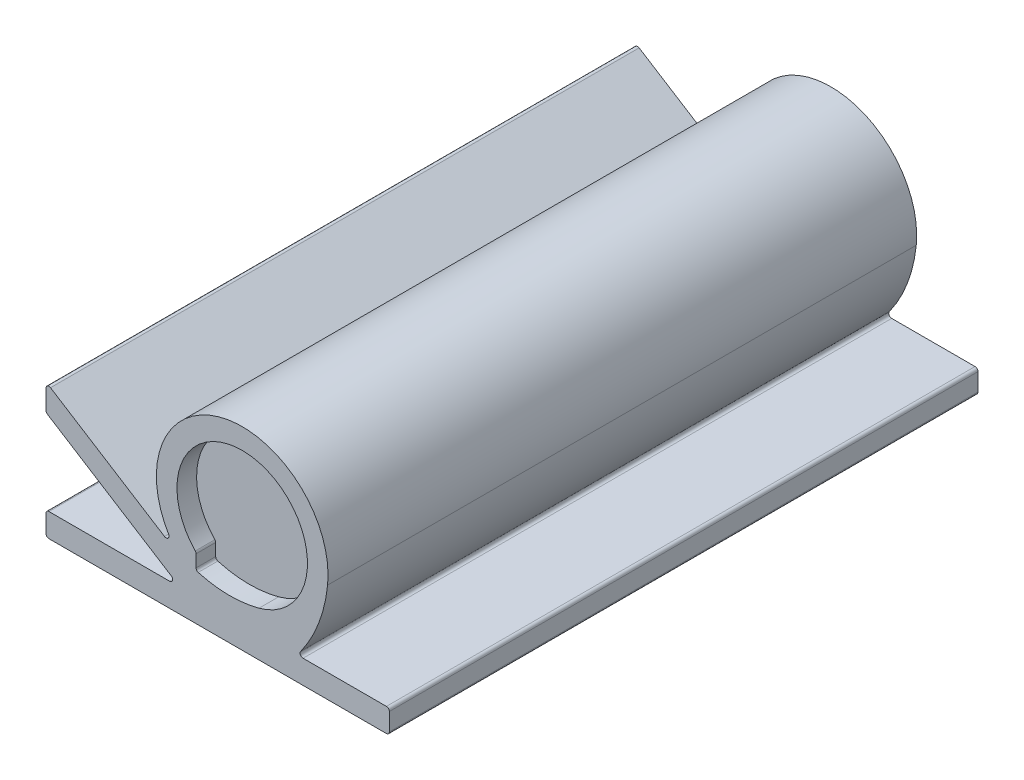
ISO-10303-21;
HEADER;
FILE_DESCRIPTION(('STEP AP214'),'2;1');
FILE_NAME('part.step','',(''),(''),'','','');
FILE_SCHEMA(('AUTOMOTIVE_DESIGN { 1 0 10303 214 1 1 1 1 }'));
ENDSEC;
DATA;
#1=APPLICATION_CONTEXT('core data for automotive mechanical design processes');
#2=APPLICATION_PROTOCOL_DEFINITION('international standard','automotive_design',2000,#1);
#3=PRODUCT_CONTEXT('',#1,'mechanical');
#4=PRODUCT('Part','Part','',(#3));
#5=PRODUCT_RELATED_PRODUCT_CATEGORY('part','',(#4));
#6=PRODUCT_DEFINITION_FORMATION('','',#4);
#7=PRODUCT_DEFINITION_CONTEXT('part definition',#1,'design');
#8=PRODUCT_DEFINITION('design','',#6,#7);
#9=PRODUCT_DEFINITION_SHAPE('','',#8);
#10=(LENGTH_UNIT() NAMED_UNIT(*) SI_UNIT(.MILLI.,.METRE.));
#11=(NAMED_UNIT(*) PLANE_ANGLE_UNIT() SI_UNIT($,.RADIAN.));
#12=(NAMED_UNIT(*) SI_UNIT($,.STERADIAN.) SOLID_ANGLE_UNIT());
#13=UNCERTAINTY_MEASURE_WITH_UNIT(LENGTH_MEASURE(1.E-05),#10,'distance_accuracy_value','');
#14=(GEOMETRIC_REPRESENTATION_CONTEXT(3) GLOBAL_UNCERTAINTY_ASSIGNED_CONTEXT((#13)) GLOBAL_UNIT_ASSIGNED_CONTEXT((#10,
#11,#12)) REPRESENTATION_CONTEXT('',''));
#15=CARTESIAN_POINT('',(0.,0.,0.));
#16=DIRECTION('',(0.,0.,1.));
#17=DIRECTION('',(1.,0.,0.));
#18=AXIS2_PLACEMENT_3D('',#15,#16,#17);
#19=CARTESIAN_POINT('',(-20.,0.,60.));
#20=DIRECTION('',(1.,0.,0.));
#21=DIRECTION('',(0.,0.,-1.));
#22=AXIS2_PLACEMENT_3D('',#19,#20,#21);
#23=PLANE('',#22);
#24=DIRECTION('',(0.,-1.,0.));
#25=VECTOR('',#24,1.);
#26=CARTESIAN_POINT('',(-20.,0.,0.));
#27=LINE('',#26,#25);
#28=CARTESIAN_POINT('',(-20.,2.1,0.));
#29=VERTEX_POINT('',#28);
#30=CARTESIAN_POINT('',(-20.,0.3,0.));
#31=VERTEX_POINT('',#30);
#32=EDGE_CURVE('E226',#29,#31,#27,.T.);
#33=ORIENTED_EDGE('',*,*,#32,.T.);
#34=DIRECTION('',(0.,0.,-1.));
#35=VECTOR('',#34,1.);
#36=CARTESIAN_POINT('',(-20.,0.3,60.));
#37=LINE('',#36,#35);
#38=CARTESIAN_POINT('',(-20.,0.3,60.));
#39=VERTEX_POINT('',#38);
#40=EDGE_CURVE('E434',#31,#39,#37,.F.);
#41=ORIENTED_EDGE('',*,*,#40,.T.);
#42=DIRECTION('',(0.,-1.,0.));
#43=VECTOR('',#42,1.);
#44=CARTESIAN_POINT('',(-20.,0.,60.));
#45=LINE('',#44,#43);
#46=CARTESIAN_POINT('',(-20.,2.1,60.));
#47=VERTEX_POINT('',#46);
#48=EDGE_CURVE('E245',#47,#39,#45,.T.);
#49=ORIENTED_EDGE('',*,*,#48,.F.);
#50=DIRECTION('',(0.,0.,-1.));
#51=VECTOR('',#50,1.);
#52=CARTESIAN_POINT('',(-20.,2.1,60.));
#53=LINE('',#52,#51);
#54=EDGE_CURVE('E430',#47,#29,#53,.T.);
#55=ORIENTED_EDGE('',*,*,#54,.T.);
#56=EDGE_LOOP('',(#33,#41,#49,#55));
#57=FACE_BOUND('',#56,.T.);
#58=ADVANCED_FACE('F39',(#57),#23,.F.);
#59=CARTESIAN_POINT('',(-20.,0.,60.));
#60=DIRECTION('',(0.,1.,0.));
#61=DIRECTION('',(0.,0.,1.));
#62=AXIS2_PLACEMENT_3D('',#59,#60,#61);
#63=PLANE('',#62);
#64=DIRECTION('',(1.,0.,0.));
#65=VECTOR('',#64,1.);
#66=CARTESIAN_POINT('',(-20.,0.,0.));
#67=LINE('',#66,#65);
#68=CARTESIAN_POINT('',(-19.7,0.,0.));
#69=VERTEX_POINT('',#68);
#70=CARTESIAN_POINT('',(14.7,0.,0.));
#71=VERTEX_POINT('',#70);
#72=EDGE_CURVE('E287',#69,#71,#67,.T.);
#73=ORIENTED_EDGE('',*,*,#72,.T.);
#74=DIRECTION('',(0.,0.,-1.));
#75=VECTOR('',#74,1.);
#76=CARTESIAN_POINT('',(14.7,0.,60.));
#77=LINE('',#76,#75);
#78=CARTESIAN_POINT('',(14.7,0.,60.));
#79=VERTEX_POINT('',#78);
#80=EDGE_CURVE('E399',#71,#79,#77,.F.);
#81=ORIENTED_EDGE('',*,*,#80,.T.);
#82=DIRECTION('',(1.,0.,0.));
#83=VECTOR('',#82,1.);
#84=CARTESIAN_POINT('',(-20.,0.,60.));
#85=LINE('',#84,#83);
#86=CARTESIAN_POINT('',(-19.7,0.,60.));
#87=VERTEX_POINT('',#86);
#88=EDGE_CURVE('E249',#87,#79,#85,.T.);
#89=ORIENTED_EDGE('',*,*,#88,.F.);
#90=DIRECTION('',(0.,0.,-1.));
#91=VECTOR('',#90,1.);
#92=CARTESIAN_POINT('',(-19.7,0.,60.));
#93=LINE('',#92,#91);
#94=EDGE_CURVE('E395',#87,#69,#93,.T.);
#95=ORIENTED_EDGE('',*,*,#94,.T.);
#96=EDGE_LOOP('',(#73,#81,#89,#95));
#97=FACE_BOUND('',#96,.T.);
#98=ADVANCED_FACE('F490',(#97),#63,.F.);
#99=CARTESIAN_POINT('',(15.,0.,60.));
#100=DIRECTION('',(-1.,0.,0.));
#101=DIRECTION('',(0.,0.,1.));
#102=AXIS2_PLACEMENT_3D('',#99,#100,#101);
#103=PLANE('',#102);
#104=DIRECTION('',(0.,1.,0.));
#105=VECTOR('',#104,1.);
#106=CARTESIAN_POINT('',(15.,0.,60.));
#107=LINE('',#106,#105);
#108=CARTESIAN_POINT('',(15.,0.3,60.));
#109=VERTEX_POINT('',#108);
#110=CARTESIAN_POINT('',(15.,2.1,60.));
#111=VERTEX_POINT('',#110);
#112=EDGE_CURVE('E254',#109,#111,#107,.T.);
#113=ORIENTED_EDGE('',*,*,#112,.F.);
#114=DIRECTION('',(0.,0.,-1.));
#115=VECTOR('',#114,1.);
#116=CARTESIAN_POINT('',(15.,0.3,60.));
#117=LINE('',#116,#115);
#118=CARTESIAN_POINT('',(15.,0.3,0.));
#119=VERTEX_POINT('',#118);
#120=EDGE_CURVE('E373',#109,#119,#117,.T.);
#121=ORIENTED_EDGE('',*,*,#120,.T.);
#122=DIRECTION('',(0.,1.,0.));
#123=VECTOR('',#122,1.);
#124=CARTESIAN_POINT('',(15.,0.,0.));
#125=LINE('',#124,#123);
#126=CARTESIAN_POINT('',(15.,2.1,0.));
#127=VERTEX_POINT('',#126);
#128=EDGE_CURVE('E291',#119,#127,#125,.T.);
#129=ORIENTED_EDGE('',*,*,#128,.T.);
#130=DIRECTION('',(0.,0.,-1.));
#131=VECTOR('',#130,1.);
#132=CARTESIAN_POINT('',(15.,2.1,60.));
#133=LINE('',#132,#131);
#134=EDGE_CURVE('E370',#127,#111,#133,.F.);
#135=ORIENTED_EDGE('',*,*,#134,.T.);
#136=EDGE_LOOP('',(#113,#121,#129,#135));
#137=FACE_BOUND('',#136,.T.);
#138=ADVANCED_FACE('F482',(#137),#103,.F.);
#139=CARTESIAN_POINT('',(15.,2.4,60.));
#140=DIRECTION('',(0.,-1.,0.));
#141=DIRECTION('',(1.,0.,0.));
#142=AXIS2_PLACEMENT_3D('',#139,#140,#141);
#143=PLANE('',#142);
#144=DIRECTION('',(-1.,0.,0.));
#145=VECTOR('',#144,1.);
#146=CARTESIAN_POINT('',(15.,2.4,0.));
#147=LINE('',#146,#145);
#148=CARTESIAN_POINT('',(14.7,2.4,0.));
#149=VERTEX_POINT('',#148);
#150=CARTESIAN_POINT('',(6.20009702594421,2.4,0.));
#151=VERTEX_POINT('',#150);
#152=EDGE_CURVE('E295',#149,#151,#147,.T.);
#153=ORIENTED_EDGE('',*,*,#152,.T.);
#154=DIRECTION('',(0.,0.,1.));
#155=VECTOR('',#154,1.);
#156=CARTESIAN_POINT('',(6.20009702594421,2.4,60.));
#157=LINE('',#156,#155);
#158=CARTESIAN_POINT('',(6.20009702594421,2.4,60.));
#159=VERTEX_POINT('',#158);
#160=EDGE_CURVE('E367',#151,#159,#157,.T.);
#161=ORIENTED_EDGE('',*,*,#160,.T.);
#162=DIRECTION('',(-1.,0.,0.));
#163=VECTOR('',#162,1.);
#164=CARTESIAN_POINT('',(15.,2.4,60.));
#165=LINE('',#164,#163);
#166=CARTESIAN_POINT('',(14.7,2.4,60.));
#167=VERTEX_POINT('',#166);
#168=EDGE_CURVE('E258',#167,#159,#165,.T.);
#169=ORIENTED_EDGE('',*,*,#168,.F.);
#170=DIRECTION('',(0.,0.,-1.));
#171=VECTOR('',#170,1.);
#172=CARTESIAN_POINT('',(14.7,2.4,60.));
#173=LINE('',#172,#171);
#174=EDGE_CURVE('E363',#167,#149,#173,.T.);
#175=ORIENTED_EDGE('',*,*,#174,.T.);
#176=EDGE_LOOP('',(#153,#161,#169,#175));
#177=FACE_BOUND('',#176,.T.);
#178=ADVANCED_FACE('F474',(#177),#143,.F.);
#179=CARTESIAN_POINT('',(-6.21729001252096,11.6385960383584,60.));
#180=DIRECTION('',(0.,0.,-1.));
#181=DIRECTION('',(-1.,0.,0.));
#182=AXIS2_PLACEMENT_3D('',#179,#180,#181);
#183=CYLINDRICAL_SURFACE('',#182,15.);
#184=CARTESIAN_POINT('',(-6.21729001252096,11.6385960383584,60.));
#185=DIRECTION('',(0.,0.,1.));
#186=DIRECTION('',(1.,0.,0.));
#187=AXIS2_PLACEMENT_3D('',#184,#185,#186);
#188=CIRCLE('',#187,15.);
#189=CARTESIAN_POINT('',(5.9566188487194,2.87526658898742,60.));
#190=VERTEX_POINT('',#189);
#191=CARTESIAN_POINT('',(8.70420601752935,10.1059655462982,60.));
#192=VERTEX_POINT('',#191);
#193=EDGE_CURVE('E262',#190,#192,#188,.T.);
#194=ORIENTED_EDGE('',*,*,#193,.F.);
#195=DIRECTION('',(0.,0.,-1.));
#196=VECTOR('',#195,1.);
#197=CARTESIAN_POINT('',(5.9566188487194,2.87526658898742,60.));
#198=LINE('',#197,#196);
#199=CARTESIAN_POINT('',(5.9566188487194,2.87526658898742,0.));
#200=VERTEX_POINT('',#199);
#201=EDGE_CURVE('E359',#190,#200,#198,.T.);
#202=ORIENTED_EDGE('',*,*,#201,.T.);
#203=CARTESIAN_POINT('',(-6.21729001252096,11.6385960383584,0.));
#204=DIRECTION('',(0.,0.,1.));
#205=DIRECTION('',(1.,0.,0.));
#206=AXIS2_PLACEMENT_3D('',#203,#204,#205);
#207=CIRCLE('',#206,15.);
#208=CARTESIAN_POINT('',(8.70420601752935,10.1059655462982,0.));
#209=VERTEX_POINT('',#208);
#210=EDGE_CURVE('E299',#200,#209,#207,.T.);
#211=ORIENTED_EDGE('',*,*,#210,.T.);
#212=DIRECTION('',(0.,0.,-1.));
#213=VECTOR('',#212,1.);
#214=CARTESIAN_POINT('',(8.70420601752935,10.1059655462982,60.));
#215=LINE('',#214,#213);
#216=EDGE_CURVE('E283',#192,#209,#215,.T.);
#217=ORIENTED_EDGE('',*,*,#216,.F.);
#218=EDGE_LOOP('',(#194,#202,#211,#217));
#219=FACE_BOUND('',#218,.T.);
#220=ADVANCED_FACE('F464',(#219),#183,.T.);
#221=CARTESIAN_POINT('',(0.,11.,60.));
#222=DIRECTION('',(0.,0.,-1.));
#223=DIRECTION('',(-1.,0.,0.));
#224=AXIS2_PLACEMENT_3D('',#221,#222,#223);
#225=CYLINDRICAL_SURFACE('',#224,8.75);
#226=CARTESIAN_POINT('',(0.,11.,0.));
#227=DIRECTION('',(0.,0.,1.));
#228=DIRECTION('',(1.,0.,0.));
#229=AXIS2_PLACEMENT_3D('',#226,#227,#228);
#230=CIRCLE('',#229,8.75);
#231=CARTESIAN_POINT('',(-7.50242086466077,6.49709192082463,0.));
#232=VERTEX_POINT('',#231);
#233=EDGE_CURVE('E302',#209,#232,#230,.T.);
#234=ORIENTED_EDGE('',*,*,#233,.T.);
#235=DIRECTION('',(0.,0.,-1.));
#236=VECTOR('',#235,1.);
#237=CARTESIAN_POINT('',(-7.50242086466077,6.49709192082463,60.));
#238=LINE('',#237,#236);
#239=CARTESIAN_POINT('',(-7.50242086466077,6.49709192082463,60.));
#240=VERTEX_POINT('',#239);
#241=EDGE_CURVE('E342',#232,#240,#238,.F.);
#242=ORIENTED_EDGE('',*,*,#241,.T.);
#243=CARTESIAN_POINT('',(0.,11.,60.));
#244=DIRECTION('',(0.,0.,1.));
#245=DIRECTION('',(1.,0.,0.));
#246=AXIS2_PLACEMENT_3D('',#243,#244,#245);
#247=CIRCLE('',#246,8.75);
#248=EDGE_CURVE('E265',#192,#240,#247,.T.);
#249=ORIENTED_EDGE('',*,*,#248,.F.);
#250=ORIENTED_EDGE('',*,*,#216,.T.);
#251=EDGE_LOOP('',(#234,#242,#249,#250));
#252=FACE_BOUND('',#251,.T.);
#253=ADVANCED_FACE('F537',(#252),#225,.T.);
#254=CARTESIAN_POINT('',(-20.,13.7,60.));
#255=DIRECTION('',(-0.533059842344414,-0.846077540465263,0.));
#256=DIRECTION('',(0.846077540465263,-0.533059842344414,0.));
#257=AXIS2_PLACEMENT_3D('',#254,#255,#256);
#258=PLANE('',#257);
#259=DIRECTION('',(-0.846077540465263,0.533059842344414,0.));
#260=VECTOR('',#259,1.);
#261=CARTESIAN_POINT('',(-20.,13.7,60.));
#262=LINE('',#261,#260);
#263=CARTESIAN_POINT('',(-7.91956467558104,6.08888323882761,60.));
#264=VERTEX_POINT('',#263);
#265=CARTESIAN_POINT('',(-19.5400820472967,13.4102348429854,60.));
#266=VERTEX_POINT('',#265);
#267=EDGE_CURVE('E269',#264,#266,#262,.T.);
#268=ORIENTED_EDGE('',*,*,#267,.F.);
#269=DIRECTION('',(0.,0.,1.));
#270=VECTOR('',#269,1.);
#271=CARTESIAN_POINT('',(-7.91956467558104,6.08888323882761,0.));
#272=LINE('',#271,#270);
#273=CARTESIAN_POINT('',(-7.91956467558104,6.08888323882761,0.));
#274=VERTEX_POINT('',#273);
#275=EDGE_CURVE('E338',#264,#274,#272,.F.);
#276=ORIENTED_EDGE('',*,*,#275,.T.);
#277=DIRECTION('',(-0.846077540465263,0.533059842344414,0.));
#278=VECTOR('',#277,1.);
#279=CARTESIAN_POINT('',(-20.,13.7,0.));
#280=LINE('',#279,#278);
#281=CARTESIAN_POINT('',(-19.5400820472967,13.4102348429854,0.));
#282=VERTEX_POINT('',#281);
#283=EDGE_CURVE('E306',#274,#282,#280,.T.);
#284=ORIENTED_EDGE('',*,*,#283,.T.);
#285=DIRECTION('',(0.,0.,-1.));
#286=VECTOR('',#285,1.);
#287=CARTESIAN_POINT('',(-19.5400820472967,13.4102348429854,60.));
#288=LINE('',#287,#286);
#289=EDGE_CURVE('E335',#282,#266,#288,.F.);
#290=ORIENTED_EDGE('',*,*,#289,.T.);
#291=EDGE_LOOP('',(#268,#276,#284,#290));
#292=FACE_BOUND('',#291,.T.);
#293=ADVANCED_FACE('F530',(#292),#258,.F.);
#294=CARTESIAN_POINT('',(-20.,11.,60.));
#295=DIRECTION('',(1.,0.,0.));
#296=DIRECTION('',(0.,0.,-1.));
#297=AXIS2_PLACEMENT_3D('',#294,#295,#296);
#298=PLANE('',#297);
#299=DIRECTION('',(0.,-1.,0.));
#300=VECTOR('',#299,1.);
#301=CARTESIAN_POINT('',(-20.,11.,0.));
#302=LINE('',#301,#300);
#303=CARTESIAN_POINT('',(-20.,13.1564115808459,0.));
#304=VERTEX_POINT('',#303);
#305=CARTESIAN_POINT('',(-20.,11.1655664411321,0.));
#306=VERTEX_POINT('',#305);
#307=EDGE_CURVE('E310',#304,#306,#302,.T.);
#308=ORIENTED_EDGE('',*,*,#307,.T.);
#309=DIRECTION('',(0.,0.,-1.));
#310=VECTOR('',#309,1.);
#311=CARTESIAN_POINT('',(-20.,11.1655664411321,60.));
#312=LINE('',#311,#310);
#313=CARTESIAN_POINT('',(-20.,11.1655664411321,60.));
#314=VERTEX_POINT('',#313);
#315=EDGE_CURVE('E55',#306,#314,#312,.F.);
#316=ORIENTED_EDGE('',*,*,#315,.T.);
#317=DIRECTION('',(0.,-1.,0.));
#318=VECTOR('',#317,1.);
#319=CARTESIAN_POINT('',(-20.,11.,60.));
#320=LINE('',#319,#318);
#321=CARTESIAN_POINT('',(-20.,13.1564115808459,60.));
#322=VERTEX_POINT('',#321);
#323=EDGE_CURVE('E272',#322,#314,#320,.T.);
#324=ORIENTED_EDGE('',*,*,#323,.F.);
#325=DIRECTION('',(0.,0.,-1.));
#326=VECTOR('',#325,1.);
#327=CARTESIAN_POINT('',(-20.,13.1564115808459,60.));
#328=LINE('',#327,#326);
#329=EDGE_CURVE('E424',#322,#304,#328,.T.);
#330=ORIENTED_EDGE('',*,*,#329,.T.);
#331=EDGE_LOOP('',(#308,#316,#324,#330));
#332=FACE_BOUND('',#331,.T.);
#333=ADVANCED_FACE('F522',(#332),#298,.F.);
#334=CARTESIAN_POINT('',(-6.35,2.4,60.));
#335=DIRECTION('',(0.533059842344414,0.846077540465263,0.));
#336=DIRECTION('',(-0.846077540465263,0.533059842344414,0.));
#337=AXIS2_PLACEMENT_3D('',#334,#335,#336);
#338=PLANE('',#337);
#339=DIRECTION('',(0.846077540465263,-0.533059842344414,0.));
#340=VECTOR('',#339,1.);
#341=CARTESIAN_POINT('',(-6.35,2.4,0.));
#342=LINE('',#341,#340);
#343=CARTESIAN_POINT('',(-19.8599179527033,10.9117431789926,0.));
#344=VERTEX_POINT('',#343);
#345=CARTESIAN_POINT('',(-7.22903343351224,2.95382326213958,0.));
#346=VERTEX_POINT('',#345);
#347=EDGE_CURVE('E313',#344,#346,#342,.T.);
#348=ORIENTED_EDGE('',*,*,#347,.T.);
#349=DIRECTION('',(0.,0.,-1.));
#350=VECTOR('',#349,1.);
#351=CARTESIAN_POINT('',(-7.22903343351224,2.95382326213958,60.));
#352=LINE('',#351,#350);
#353=CARTESIAN_POINT('',(-7.22903343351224,2.95382326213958,60.));
#354=VERTEX_POINT('',#353);
#355=EDGE_CURVE('E356',#346,#354,#352,.F.);
#356=ORIENTED_EDGE('',*,*,#355,.T.);
#357=DIRECTION('',(0.846077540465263,-0.533059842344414,0.));
#358=VECTOR('',#357,1.);
#359=CARTESIAN_POINT('',(-6.35,2.4,60.));
#360=LINE('',#359,#358);
#361=CARTESIAN_POINT('',(-19.8599179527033,10.9117431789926,60.));
#362=VERTEX_POINT('',#361);
#363=EDGE_CURVE('E275',#362,#354,#360,.T.);
#364=ORIENTED_EDGE('',*,*,#363,.F.);
#365=DIRECTION('',(0.,0.,-1.));
#366=VECTOR('',#365,1.);
#367=CARTESIAN_POINT('',(-19.8599179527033,10.9117431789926,60.));
#368=LINE('',#367,#366);
#369=EDGE_CURVE('E352',#362,#344,#368,.T.);
#370=ORIENTED_EDGE('',*,*,#369,.T.);
#371=EDGE_LOOP('',(#348,#356,#364,#370));
#372=FACE_BOUND('',#371,.T.);
#373=ADVANCED_FACE('F515',(#372),#338,.F.);
#374=CARTESIAN_POINT('',(-20.,2.4,60.));
#375=DIRECTION('',(0.,-1.,0.));
#376=DIRECTION('',(0.,0.,-1.));
#377=AXIS2_PLACEMENT_3D('',#374,#375,#376);
#378=PLANE('',#377);
#379=DIRECTION('',(-1.,0.,0.));
#380=VECTOR('',#379,1.);
#381=CARTESIAN_POINT('',(-20.,2.4,60.));
#382=LINE('',#381,#380);
#383=CARTESIAN_POINT('',(-7.38895138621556,2.4,60.));
#384=VERTEX_POINT('',#383);
#385=CARTESIAN_POINT('',(-19.7,2.4,60.));
#386=VERTEX_POINT('',#385);
#387=EDGE_CURVE('E279',#384,#386,#382,.T.);
#388=ORIENTED_EDGE('',*,*,#387,.F.);
#389=DIRECTION('',(0.,0.,-1.));
#390=VECTOR('',#389,1.);
#391=CARTESIAN_POINT('',(-7.38895138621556,2.4,0.));
#392=LINE('',#391,#390);
#393=CARTESIAN_POINT('',(-7.38895138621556,2.4,0.));
#394=VERTEX_POINT('',#393);
#395=EDGE_CURVE('E348',#384,#394,#392,.T.);
#396=ORIENTED_EDGE('',*,*,#395,.T.);
#397=DIRECTION('',(-1.,0.,0.));
#398=VECTOR('',#397,1.);
#399=CARTESIAN_POINT('',(-20.,2.4,0.));
#400=LINE('',#399,#398);
#401=CARTESIAN_POINT('',(-19.7,2.4,0.));
#402=VERTEX_POINT('',#401);
#403=EDGE_CURVE('E250',#394,#402,#400,.T.);
#404=ORIENTED_EDGE('',*,*,#403,.T.);
#405=DIRECTION('',(0.,0.,-1.));
#406=VECTOR('',#405,1.);
#407=CARTESIAN_POINT('',(-19.7,2.4,60.));
#408=LINE('',#407,#406);
#409=EDGE_CURVE('E345',#402,#386,#408,.F.);
#410=ORIENTED_EDGE('',*,*,#409,.T.);
#411=EDGE_LOOP('',(#388,#396,#404,#410));
#412=FACE_BOUND('',#411,.T.);
#413=ADVANCED_FACE('F507',(#412),#378,.F.);
#414=CARTESIAN_POINT('',(0.,11.,60.));
#415=DIRECTION('',(0.,0.,1.));
#416=DIRECTION('',(1.,0.,0.));
#417=AXIS2_PLACEMENT_3D('',#414,#415,#416);
#418=PLANE('',#417);
#419=DIRECTION('',(0.,-1.,0.));
#420=VECTOR('',#419,1.);
#421=CARTESIAN_POINT('',(-4.70000000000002,6.29548089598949,60.));
#422=LINE('',#421,#420);
#423=CARTESIAN_POINT('',(-4.70000000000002,6.1727336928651,60.));
#424=VERTEX_POINT('',#423);
#425=CARTESIAN_POINT('',(-4.70000000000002,4.92354748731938,60.));
#426=VERTEX_POINT('',#425);
#427=EDGE_CURVE('E236',#424,#426,#422,.T.);
#428=ORIENTED_EDGE('',*,*,#427,.F.);
#429=CARTESIAN_POINT('',(-5.00000000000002,6.1727336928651,60.));
#430=DIRECTION('',(0.,0.,1.));
#431=DIRECTION('',(1.,0.,0.));
#432=AXIS2_PLACEMENT_3D('',#429,#430,#431);
#433=CIRCLE('',#432,0.3);
#434=CARTESIAN_POINT('',(-4.78417266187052,6.38110490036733,60.));
#435=VERTEX_POINT('',#434);
#436=EDGE_CURVE('E413',#424,#435,#433,.T.);
#437=ORIENTED_EDGE('',*,*,#436,.T.);
#438=CARTESIAN_POINT('',(0.,11.,60.));
#439=DIRECTION('',(0.,0.,1.));
#440=DIRECTION('',(1.,0.,0.));
#441=AXIS2_PLACEMENT_3D('',#438,#439,#440);
#442=CIRCLE('',#441,6.65);
#443=CARTESIAN_POINT('',(1.7131965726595,4.57446830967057,60.));
#444=VERTEX_POINT('',#443);
#445=EDGE_CURVE('E239',#444,#435,#442,.T.);
#446=ORIENTED_EDGE('',*,*,#445,.F.);
#447=CARTESIAN_POINT('',(-1.27523654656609,15.7829145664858,60.));
#448=DIRECTION('',(0.,0.,1.));
#449=DIRECTION('',(1.,0.,0.));
#450=AXIS2_PLACEMENT_3D('',#447,#448,#449);
#451=CIRCLE('',#450,11.6);
#452=CARTESIAN_POINT('',(-4.4829583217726,4.63524570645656,60.));
#453=VERTEX_POINT('',#452);
#454=EDGE_CURVE('E221',#453,#444,#451,.T.);
#455=ORIENTED_EDGE('',*,*,#454,.F.);
#456=CARTESIAN_POINT('',(-4.40000000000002,4.92354748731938,60.));
#457=DIRECTION('',(0.,0.,1.));
#458=DIRECTION('',(1.,0.,0.));
#459=AXIS2_PLACEMENT_3D('',#456,#457,#458);
#460=CIRCLE('',#459,0.3);
#461=EDGE_CURVE('E437',#453,#426,#460,.F.);
#462=ORIENTED_EDGE('',*,*,#461,.T.);
#463=EDGE_LOOP('',(#428,#437,#446,#455,#462));
#464=FACE_BOUND('',#463,.T.);
#465=ORIENTED_EDGE('',*,*,#88,.T.);
#466=CARTESIAN_POINT('',(14.7,0.3,60.));
#467=DIRECTION('',(0.,0.,1.));
#468=DIRECTION('',(1.,0.,0.));
#469=AXIS2_PLACEMENT_3D('',#466,#467,#468);
#470=CIRCLE('',#469,0.3);
#471=EDGE_CURVE('E419',#79,#109,#470,.T.);
#472=ORIENTED_EDGE('',*,*,#471,.T.);
#473=ORIENTED_EDGE('',*,*,#112,.T.);
#474=CARTESIAN_POINT('',(14.7,2.1,60.));
#475=DIRECTION('',(0.,0.,1.));
#476=DIRECTION('',(1.,0.,0.));
#477=AXIS2_PLACEMENT_3D('',#474,#475,#476);
#478=CIRCLE('',#477,0.3);
#479=EDGE_CURVE('E416',#111,#167,#478,.T.);
#480=ORIENTED_EDGE('',*,*,#479,.T.);
#481=ORIENTED_EDGE('',*,*,#168,.T.);
#482=CARTESIAN_POINT('',(6.20009702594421,2.7,60.));
#483=DIRECTION('',(0.,0.,1.));
#484=DIRECTION('',(1.,0.,0.));
#485=AXIS2_PLACEMENT_3D('',#482,#483,#484);
#486=CIRCLE('',#485,0.3);
#487=EDGE_CURVE('E48',#159,#190,#486,.F.);
#488=ORIENTED_EDGE('',*,*,#487,.T.);
#489=ORIENTED_EDGE('',*,*,#193,.T.);
#490=ORIENTED_EDGE('',*,*,#248,.T.);
#491=CARTESIAN_POINT('',(-7.75964672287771,6.34270650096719,60.));
#492=DIRECTION('',(0.,0.,1.));
#493=DIRECTION('',(1.,0.,0.));
#494=AXIS2_PLACEMENT_3D('',#491,#492,#493);
#495=CIRCLE('',#494,0.3);
#496=EDGE_CURVE('E443',#240,#264,#495,.F.);
#497=ORIENTED_EDGE('',*,*,#496,.T.);
#498=ORIENTED_EDGE('',*,*,#267,.T.);
#499=CARTESIAN_POINT('',(-19.7,13.1564115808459,60.));
#500=DIRECTION('',(0.,0.,1.));
#501=DIRECTION('',(1.,0.,0.));
#502=AXIS2_PLACEMENT_3D('',#499,#500,#501);
#503=CIRCLE('',#502,0.3);
#504=EDGE_CURVE('E62',#266,#322,#503,.T.);
#505=ORIENTED_EDGE('',*,*,#504,.T.);
#506=ORIENTED_EDGE('',*,*,#323,.T.);
#507=CARTESIAN_POINT('',(-19.7,11.1655664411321,60.));
#508=DIRECTION('',(0.,0.,1.));
#509=DIRECTION('',(1.,0.,0.));
#510=AXIS2_PLACEMENT_3D('',#507,#508,#509);
#511=CIRCLE('',#510,0.3);
#512=EDGE_CURVE('E410',#314,#362,#511,.T.);
#513=ORIENTED_EDGE('',*,*,#512,.T.);
#514=ORIENTED_EDGE('',*,*,#363,.T.);
#515=CARTESIAN_POINT('',(-7.38895138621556,2.7,60.));
#516=DIRECTION('',(0.,0.,1.));
#517=DIRECTION('',(1.,0.,0.));
#518=AXIS2_PLACEMENT_3D('',#515,#516,#517);
#519=CIRCLE('',#518,0.3);
#520=EDGE_CURVE('E449',#354,#384,#519,.F.);
#521=ORIENTED_EDGE('',*,*,#520,.T.);
#522=ORIENTED_EDGE('',*,*,#387,.T.);
#523=CARTESIAN_POINT('',(-19.7,2.1,60.));
#524=DIRECTION('',(0.,0.,1.));
#525=DIRECTION('',(1.,0.,0.));
#526=AXIS2_PLACEMENT_3D('',#523,#524,#525);
#527=CIRCLE('',#526,0.3);
#528=EDGE_CURVE('E402',#386,#47,#527,.T.);
#529=ORIENTED_EDGE('',*,*,#528,.T.);
#530=ORIENTED_EDGE('',*,*,#48,.T.);
#531=CARTESIAN_POINT('',(-19.7,0.3,60.));
#532=DIRECTION('',(0.,0.,1.));
#533=DIRECTION('',(1.,0.,0.));
#534=AXIS2_PLACEMENT_3D('',#531,#532,#533);
#535=CIRCLE('',#534,0.3);
#536=EDGE_CURVE('E405',#39,#87,#535,.T.);
#537=ORIENTED_EDGE('',*,*,#536,.T.);
#538=EDGE_LOOP('',(#465,#472,#473,#480,#481,#488,#489,#490,#497,#498,#505,#506,#513,#514,#521,
#522,#529,#530,#537));
#539=FACE_BOUND('',#538,.T.);
#540=ADVANCED_FACE('F457',(#464,#539),#418,.T.);
#541=CARTESIAN_POINT('',(0.,11.,0.));
#542=DIRECTION('',(0.,0.,1.));
#543=DIRECTION('',(1.,0.,0.));
#544=AXIS2_PLACEMENT_3D('',#541,#542,#543);
#545=PLANE('',#544);
#546=ORIENTED_EDGE('',*,*,#128,.F.);
#547=CARTESIAN_POINT('',(14.7,0.3,0.));
#548=DIRECTION('',(0.,0.,1.));
#549=DIRECTION('',(1.,0.,0.));
#550=AXIS2_PLACEMENT_3D('',#547,#548,#549);
#551=CIRCLE('',#550,0.3);
#552=EDGE_CURVE('E392',#119,#71,#551,.F.);
#553=ORIENTED_EDGE('',*,*,#552,.T.);
#554=ORIENTED_EDGE('',*,*,#72,.F.);
#555=CARTESIAN_POINT('',(-19.7,0.3,0.));
#556=DIRECTION('',(0.,0.,1.));
#557=DIRECTION('',(1.,0.,0.));
#558=AXIS2_PLACEMENT_3D('',#555,#556,#557);
#559=CIRCLE('',#558,0.3);
#560=EDGE_CURVE('E380',#69,#31,#559,.F.);
#561=ORIENTED_EDGE('',*,*,#560,.T.);
#562=ORIENTED_EDGE('',*,*,#32,.F.);
#563=CARTESIAN_POINT('',(-19.7,2.1,0.));
#564=DIRECTION('',(0.,0.,1.));
#565=DIRECTION('',(1.,0.,0.));
#566=AXIS2_PLACEMENT_3D('',#563,#564,#565);
#567=CIRCLE('',#566,0.3);
#568=EDGE_CURVE('E377',#29,#402,#567,.F.);
#569=ORIENTED_EDGE('',*,*,#568,.T.);
#570=ORIENTED_EDGE('',*,*,#403,.F.);
#571=CARTESIAN_POINT('',(-7.38895138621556,2.7,0.));
#572=DIRECTION('',(0.,0.,1.));
#573=DIRECTION('',(1.,0.,0.));
#574=AXIS2_PLACEMENT_3D('',#571,#572,#573);
#575=CIRCLE('',#574,0.3);
#576=EDGE_CURVE('E446',#394,#346,#575,.T.);
#577=ORIENTED_EDGE('',*,*,#576,.T.);
#578=ORIENTED_EDGE('',*,*,#347,.F.);
#579=CARTESIAN_POINT('',(-19.7,11.1655664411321,0.));
#580=DIRECTION('',(0.,0.,1.));
#581=DIRECTION('',(1.,0.,0.));
#582=AXIS2_PLACEMENT_3D('',#579,#580,#581);
#583=CIRCLE('',#582,0.3);
#584=EDGE_CURVE('E386',#344,#306,#583,.F.);
#585=ORIENTED_EDGE('',*,*,#584,.T.);
#586=ORIENTED_EDGE('',*,*,#307,.F.);
#587=CARTESIAN_POINT('',(-19.7,13.1564115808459,0.));
#588=DIRECTION('',(0.,0.,1.));
#589=DIRECTION('',(1.,0.,0.));
#590=AXIS2_PLACEMENT_3D('',#587,#588,#589);
#591=CIRCLE('',#590,0.3);
#592=EDGE_CURVE('E383',#304,#282,#591,.F.);
#593=ORIENTED_EDGE('',*,*,#592,.T.);
#594=ORIENTED_EDGE('',*,*,#283,.F.);
#595=CARTESIAN_POINT('',(-7.75964672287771,6.34270650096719,0.));
#596=DIRECTION('',(0.,0.,1.));
#597=DIRECTION('',(1.,0.,0.));
#598=AXIS2_PLACEMENT_3D('',#595,#596,#597);
#599=CIRCLE('',#598,0.3);
#600=EDGE_CURVE('E440',#274,#232,#599,.T.);
#601=ORIENTED_EDGE('',*,*,#600,.T.);
#602=ORIENTED_EDGE('',*,*,#233,.F.);
#603=ORIENTED_EDGE('',*,*,#210,.F.);
#604=CARTESIAN_POINT('',(6.20009702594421,2.7,0.));
#605=DIRECTION('',(0.,0.,1.));
#606=DIRECTION('',(1.,0.,0.));
#607=AXIS2_PLACEMENT_3D('',#604,#605,#606);
#608=CIRCLE('',#607,0.3);
#609=EDGE_CURVE('E452',#200,#151,#608,.T.);
#610=ORIENTED_EDGE('',*,*,#609,.T.);
#611=ORIENTED_EDGE('',*,*,#152,.F.);
#612=CARTESIAN_POINT('',(14.7,2.1,0.));
#613=DIRECTION('',(0.,0.,1.));
#614=DIRECTION('',(1.,0.,0.));
#615=AXIS2_PLACEMENT_3D('',#612,#613,#614);
#616=CIRCLE('',#615,0.3);
#617=EDGE_CURVE('E389',#149,#127,#616,.F.);
#618=ORIENTED_EDGE('',*,*,#617,.T.);
#619=EDGE_LOOP('',(#546,#553,#554,#561,#562,#569,#570,#577,#578,#585,#586,#593,#594,#601,#602,
#603,#610,#611,#618));
#620=FACE_BOUND('',#619,.T.);
#621=ADVANCED_FACE('F471',(#620),#545,.F.);
#622=CARTESIAN_POINT('',(0.,11.,58.));
#623=DIRECTION('',(0.,0.,1.));
#624=DIRECTION('',(1.,0.,0.));
#625=AXIS2_PLACEMENT_3D('',#622,#623,#624);
#626=CYLINDRICAL_SURFACE('',#625,6.65);
#627=ORIENTED_EDGE('',*,*,#445,.T.);
#628=DIRECTION('',(0.,0.,1.));
#629=VECTOR('',#628,1.);
#630=CARTESIAN_POINT('',(-4.78417266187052,6.38110490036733,58.));
#631=LINE('',#630,#629);
#632=CARTESIAN_POINT('',(-4.78417266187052,6.38110490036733,58.));
#633=VERTEX_POINT('',#632);
#634=EDGE_CURVE('E230',#435,#633,#631,.F.);
#635=ORIENTED_EDGE('',*,*,#634,.T.);
#636=CARTESIAN_POINT('',(0.,11.,58.));
#637=DIRECTION('',(0.,0.,1.));
#638=DIRECTION('',(1.,0.,0.));
#639=AXIS2_PLACEMENT_3D('',#636,#637,#638);
#640=CIRCLE('',#639,6.65);
#641=CARTESIAN_POINT('',(1.7131965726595,4.57446830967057,58.));
#642=VERTEX_POINT('',#641);
#643=EDGE_CURVE('E207',#642,#633,#640,.T.);
#644=ORIENTED_EDGE('',*,*,#643,.F.);
#645=DIRECTION('',(0.,0.,1.));
#646=VECTOR('',#645,1.);
#647=CARTESIAN_POINT('',(1.7131965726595,4.57446830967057,58.));
#648=LINE('',#647,#646);
#649=EDGE_CURVE('E215',#642,#444,#648,.T.);
#650=ORIENTED_EDGE('',*,*,#649,.T.);
#651=EDGE_LOOP('',(#627,#635,#644,#650));
#652=FACE_BOUND('',#651,.T.);
#653=ADVANCED_FACE('F228',(#652),#626,.F.);
#654=CARTESIAN_POINT('',(-1.27523654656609,15.7829145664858,58.));
#655=DIRECTION('',(0.,0.,1.));
#656=DIRECTION('',(1.,0.,0.));
#657=AXIS2_PLACEMENT_3D('',#654,#655,#656);
#658=CYLINDRICAL_SURFACE('',#657,11.6);
#659=CARTESIAN_POINT('',(-1.27523654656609,15.7829145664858,58.));
#660=DIRECTION('',(0.,0.,1.));
#661=DIRECTION('',(1.,0.,0.));
#662=AXIS2_PLACEMENT_3D('',#659,#660,#661);
#663=CIRCLE('',#662,11.6);
#664=CARTESIAN_POINT('',(-4.4829583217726,4.63524570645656,58.));
#665=VERTEX_POINT('',#664);
#666=EDGE_CURVE('E202',#665,#642,#663,.T.);
#667=ORIENTED_EDGE('',*,*,#666,.F.);
#668=DIRECTION('',(0.,0.,1.));
#669=VECTOR('',#668,1.);
#670=CARTESIAN_POINT('',(-4.4829583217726,4.63524570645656,58.));
#671=LINE('',#670,#669);
#672=EDGE_CURVE('E323',#665,#453,#671,.T.);
#673=ORIENTED_EDGE('',*,*,#672,.T.);
#674=ORIENTED_EDGE('',*,*,#454,.T.);
#675=ORIENTED_EDGE('',*,*,#649,.F.);
#676=EDGE_LOOP('',(#667,#673,#674,#675));
#677=FACE_BOUND('',#676,.T.);
#678=ADVANCED_FACE('F219',(#677),#658,.F.);
#679=CARTESIAN_POINT('',(-4.70000000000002,6.29548089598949,58.));
#680=DIRECTION('',(-1.,0.,0.));
#681=DIRECTION('',(0.,0.,1.));
#682=AXIS2_PLACEMENT_3D('',#679,#680,#681);
#683=PLANE('',#682);
#684=ORIENTED_EDGE('',*,*,#427,.T.);
#685=DIRECTION('',(0.,0.,-1.));
#686=VECTOR('',#685,1.);
#687=CARTESIAN_POINT('',(-4.70000000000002,4.92354748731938,58.));
#688=LINE('',#687,#686);
#689=CARTESIAN_POINT('',(-4.70000000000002,4.92354748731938,58.));
#690=VERTEX_POINT('',#689);
#691=EDGE_CURVE('E330',#426,#690,#688,.T.);
#692=ORIENTED_EDGE('',*,*,#691,.T.);
#693=DIRECTION('',(0.,-1.,0.));
#694=VECTOR('',#693,1.);
#695=CARTESIAN_POINT('',(-4.70000000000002,6.29548089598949,58.));
#696=LINE('',#695,#694);
#697=CARTESIAN_POINT('',(-4.70000000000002,6.1727336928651,58.));
#698=VERTEX_POINT('',#697);
#699=EDGE_CURVE('E216',#698,#690,#696,.T.);
#700=ORIENTED_EDGE('',*,*,#699,.F.);
#701=DIRECTION('',(0.,0.,1.));
#702=VECTOR('',#701,1.);
#703=CARTESIAN_POINT('',(-4.70000000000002,6.1727336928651,58.));
#704=LINE('',#703,#702);
#705=EDGE_CURVE('E326',#698,#424,#704,.T.);
#706=ORIENTED_EDGE('',*,*,#705,.T.);
#707=EDGE_LOOP('',(#684,#692,#700,#706));
#708=FACE_BOUND('',#707,.T.);
#709=ADVANCED_FACE('F648',(#708),#683,.F.);
#710=CARTESIAN_POINT('',(0.,11.,58.));
#711=DIRECTION('',(0.,0.,1.));
#712=DIRECTION('',(1.,0.,0.));
#713=AXIS2_PLACEMENT_3D('',#710,#711,#712);
#714=PLANE('',#713);
#715=ORIENTED_EDGE('',*,*,#699,.T.);
#716=CARTESIAN_POINT('',(-4.40000000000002,4.92354748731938,58.));
#717=DIRECTION('',(0.,0.,1.));
#718=DIRECTION('',(1.,0.,0.));
#719=AXIS2_PLACEMENT_3D('',#716,#717,#718);
#720=CIRCLE('',#719,0.3);
#721=EDGE_CURVE('E210',#690,#665,#720,.T.);
#722=ORIENTED_EDGE('',*,*,#721,.T.);
#723=ORIENTED_EDGE('',*,*,#666,.T.);
#724=ORIENTED_EDGE('',*,*,#643,.T.);
#725=CARTESIAN_POINT('',(-5.00000000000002,6.1727336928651,58.));
#726=DIRECTION('',(0.,0.,1.));
#727=DIRECTION('',(1.,0.,0.));
#728=AXIS2_PLACEMENT_3D('',#725,#726,#727);
#729=CIRCLE('',#728,0.3);
#730=EDGE_CURVE('E11',#633,#698,#729,.F.);
#731=ORIENTED_EDGE('',*,*,#730,.T.);
#732=EDGE_LOOP('',(#715,#722,#723,#724,#731));
#733=FACE_BOUND('',#732,.T.);
#734=ADVANCED_FACE('F205',(#733),#714,.T.);
#735=CARTESIAN_POINT('',(-4.40000000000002,4.92354748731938,58.));
#736=DIRECTION('',(0.,0.,1.));
#737=DIRECTION('',(1.,0.,0.));
#738=AXIS2_PLACEMENT_3D('',#735,#736,#737);
#739=CYLINDRICAL_SURFACE('',#738,0.3);
#740=ORIENTED_EDGE('',*,*,#721,.F.);
#741=ORIENTED_EDGE('',*,*,#691,.F.);
#742=ORIENTED_EDGE('',*,*,#461,.F.);
#743=ORIENTED_EDGE('',*,*,#672,.F.);
#744=EDGE_LOOP('',(#740,#741,#742,#743));
#745=FACE_BOUND('',#744,.T.);
#746=ADVANCED_FACE('F554',(#745),#739,.F.);
#747=CARTESIAN_POINT('',(-7.75964672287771,6.34270650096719,60.));
#748=DIRECTION('',(0.,0.,-1.));
#749=DIRECTION('',(-1.,0.,0.));
#750=AXIS2_PLACEMENT_3D('',#747,#748,#749);
#751=CYLINDRICAL_SURFACE('',#750,0.3);
#752=ORIENTED_EDGE('',*,*,#496,.F.);
#753=ORIENTED_EDGE('',*,*,#241,.F.);
#754=ORIENTED_EDGE('',*,*,#600,.F.);
#755=ORIENTED_EDGE('',*,*,#275,.F.);
#756=EDGE_LOOP('',(#752,#753,#754,#755));
#757=FACE_BOUND('',#756,.T.);
#758=ADVANCED_FACE('F534',(#757),#751,.F.);
#759=CARTESIAN_POINT('',(-7.38895138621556,2.7,60.));
#760=DIRECTION('',(0.,0.,1.));
#761=DIRECTION('',(1.,0.,0.));
#762=AXIS2_PLACEMENT_3D('',#759,#760,#761);
#763=CYLINDRICAL_SURFACE('',#762,0.3);
#764=ORIENTED_EDGE('',*,*,#520,.F.);
#765=ORIENTED_EDGE('',*,*,#355,.F.);
#766=ORIENTED_EDGE('',*,*,#576,.F.);
#767=ORIENTED_EDGE('',*,*,#395,.F.);
#768=EDGE_LOOP('',(#764,#765,#766,#767));
#769=FACE_BOUND('',#768,.T.);
#770=ADVANCED_FACE('F511',(#769),#763,.F.);
#771=CARTESIAN_POINT('',(6.20009702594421,2.7,60.));
#772=DIRECTION('',(0.,0.,-1.));
#773=DIRECTION('',(-1.,0.,0.));
#774=AXIS2_PLACEMENT_3D('',#771,#772,#773);
#775=CYLINDRICAL_SURFACE('',#774,0.3);
#776=ORIENTED_EDGE('',*,*,#487,.F.);
#777=ORIENTED_EDGE('',*,*,#160,.F.);
#778=ORIENTED_EDGE('',*,*,#609,.F.);
#779=ORIENTED_EDGE('',*,*,#201,.F.);
#780=EDGE_LOOP('',(#776,#777,#778,#779));
#781=FACE_BOUND('',#780,.T.);
#782=ADVANCED_FACE('F467',(#781),#775,.F.);
#783=CARTESIAN_POINT('',(14.7,0.3,60.));
#784=DIRECTION('',(0.,0.,-1.));
#785=DIRECTION('',(-1.,0.,0.));
#786=AXIS2_PLACEMENT_3D('',#783,#784,#785);
#787=CYLINDRICAL_SURFACE('',#786,0.3);
#788=ORIENTED_EDGE('',*,*,#471,.F.);
#789=ORIENTED_EDGE('',*,*,#80,.F.);
#790=ORIENTED_EDGE('',*,*,#552,.F.);
#791=ORIENTED_EDGE('',*,*,#120,.F.);
#792=EDGE_LOOP('',(#788,#789,#790,#791));
#793=FACE_BOUND('',#792,.T.);
#794=ADVANCED_FACE('F486',(#793),#787,.T.);
#795=CARTESIAN_POINT('',(14.7,2.1,60.));
#796=DIRECTION('',(0.,0.,-1.));
#797=DIRECTION('',(-1.,0.,0.));
#798=AXIS2_PLACEMENT_3D('',#795,#796,#797);
#799=CYLINDRICAL_SURFACE('',#798,0.3);
#800=ORIENTED_EDGE('',*,*,#479,.F.);
#801=ORIENTED_EDGE('',*,*,#134,.F.);
#802=ORIENTED_EDGE('',*,*,#617,.F.);
#803=ORIENTED_EDGE('',*,*,#174,.F.);
#804=EDGE_LOOP('',(#800,#801,#802,#803));
#805=FACE_BOUND('',#804,.T.);
#806=ADVANCED_FACE('F478',(#805),#799,.T.);
#807=CARTESIAN_POINT('',(-5.00000000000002,6.1727336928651,58.));
#808=DIRECTION('',(0.,0.,1.));
#809=DIRECTION('',(1.,0.,0.));
#810=AXIS2_PLACEMENT_3D('',#807,#808,#809);
#811=CYLINDRICAL_SURFACE('',#810,0.3);
#812=ORIENTED_EDGE('',*,*,#730,.F.);
#813=ORIENTED_EDGE('',*,*,#634,.F.);
#814=ORIENTED_EDGE('',*,*,#436,.F.);
#815=ORIENTED_EDGE('',*,*,#705,.F.);
#816=EDGE_LOOP('',(#812,#813,#814,#815));
#817=FACE_BOUND('',#816,.T.);
#818=ADVANCED_FACE('F568',(#817),#811,.T.);
#819=CARTESIAN_POINT('',(-19.7,11.1655664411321,60.));
#820=DIRECTION('',(0.,0.,-1.));
#821=DIRECTION('',(-1.,0.,0.));
#822=AXIS2_PLACEMENT_3D('',#819,#820,#821);
#823=CYLINDRICAL_SURFACE('',#822,0.3);
#824=ORIENTED_EDGE('',*,*,#512,.F.);
#825=ORIENTED_EDGE('',*,*,#315,.F.);
#826=ORIENTED_EDGE('',*,*,#584,.F.);
#827=ORIENTED_EDGE('',*,*,#369,.F.);
#828=EDGE_LOOP('',(#824,#825,#826,#827));
#829=FACE_BOUND('',#828,.T.);
#830=ADVANCED_FACE('F520',(#829),#823,.T.);
#831=CARTESIAN_POINT('',(-19.7,13.1564115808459,60.));
#832=DIRECTION('',(0.,0.,-1.));
#833=DIRECTION('',(-1.,0.,0.));
#834=AXIS2_PLACEMENT_3D('',#831,#832,#833);
#835=CYLINDRICAL_SURFACE('',#834,0.3);
#836=ORIENTED_EDGE('',*,*,#504,.F.);
#837=ORIENTED_EDGE('',*,*,#289,.F.);
#838=ORIENTED_EDGE('',*,*,#592,.F.);
#839=ORIENTED_EDGE('',*,*,#329,.F.);
#840=EDGE_LOOP('',(#836,#837,#838,#839));
#841=FACE_BOUND('',#840,.T.);
#842=ADVANCED_FACE('F525',(#841),#835,.T.);
#843=CARTESIAN_POINT('',(-19.7,0.3,60.));
#844=DIRECTION('',(0.,0.,-1.));
#845=DIRECTION('',(-1.,0.,0.));
#846=AXIS2_PLACEMENT_3D('',#843,#844,#845);
#847=CYLINDRICAL_SURFACE('',#846,0.3);
#848=ORIENTED_EDGE('',*,*,#536,.F.);
#849=ORIENTED_EDGE('',*,*,#40,.F.);
#850=ORIENTED_EDGE('',*,*,#560,.F.);
#851=ORIENTED_EDGE('',*,*,#94,.F.);
#852=EDGE_LOOP('',(#848,#849,#850,#851));
#853=FACE_BOUND('',#852,.T.);
#854=ADVANCED_FACE('F495',(#853),#847,.T.);
#855=CARTESIAN_POINT('',(-19.7,2.1,60.));
#856=DIRECTION('',(0.,0.,-1.));
#857=DIRECTION('',(-1.,0.,0.));
#858=AXIS2_PLACEMENT_3D('',#855,#856,#857);
#859=CYLINDRICAL_SURFACE('',#858,0.3);
#860=ORIENTED_EDGE('',*,*,#528,.F.);
#861=ORIENTED_EDGE('',*,*,#409,.F.);
#862=ORIENTED_EDGE('',*,*,#568,.F.);
#863=ORIENTED_EDGE('',*,*,#54,.F.);
#864=EDGE_LOOP('',(#860,#861,#862,#863));
#865=FACE_BOUND('',#864,.T.);
#866=ADVANCED_FACE('F41',(#865),#859,.T.);
#867=CLOSED_SHELL('',(#58,#98,#138,#178,#220,#253,#293,#333,#373,#413,#540,#621,#653,#678,#709,
#734,#746,#758,#770,#782,#794,#806,#818,#830,#842,#854,#866));
#868=MANIFOLD_SOLID_BREP('B2',#867);
#869=ADVANCED_BREP_SHAPE_REPRESENTATION('',(#18,#868),#14);
#870=SHAPE_DEFINITION_REPRESENTATION(#9,#869);
ENDSEC;
END-ISO-10303-21;
